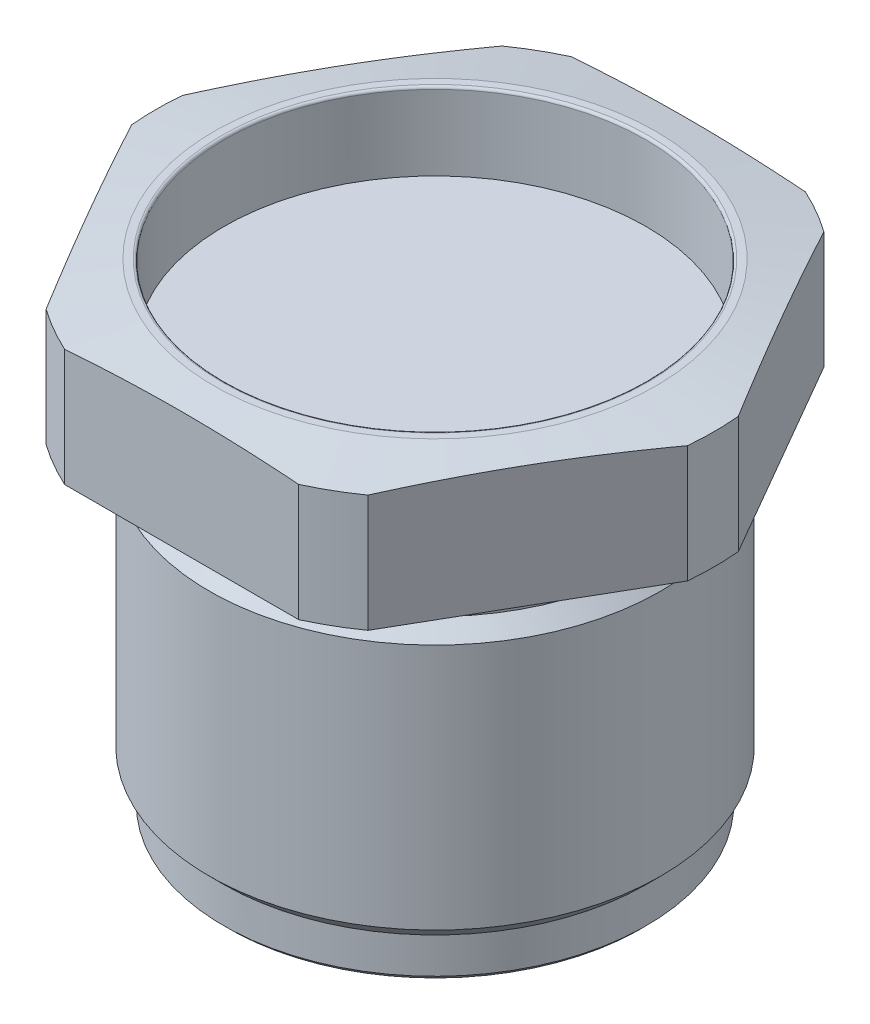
ISO-10303-21;
HEADER;
FILE_DESCRIPTION(('STEP AP214'),'2;1');
FILE_NAME('part.step','',(''),(''),'','','');
FILE_SCHEMA(('AUTOMOTIVE_DESIGN { 1 0 10303 214 1 1 1 1 }'));
ENDSEC;
DATA;
#1=APPLICATION_CONTEXT('core data for automotive mechanical design processes');
#2=APPLICATION_PROTOCOL_DEFINITION('international standard','automotive_design',2000,#1);
#3=PRODUCT_CONTEXT('',#1,'mechanical');
#4=PRODUCT('Part','Part','',(#3));
#5=PRODUCT_RELATED_PRODUCT_CATEGORY('part','',(#4));
#6=PRODUCT_DEFINITION_FORMATION('','',#4);
#7=PRODUCT_DEFINITION_CONTEXT('part definition',#1,'design');
#8=PRODUCT_DEFINITION('design','',#6,#7);
#9=PRODUCT_DEFINITION_SHAPE('','',#8);
#10=(LENGTH_UNIT() NAMED_UNIT(*) SI_UNIT(.MILLI.,.METRE.));
#11=(NAMED_UNIT(*) PLANE_ANGLE_UNIT() SI_UNIT($,.RADIAN.));
#12=(NAMED_UNIT(*) SI_UNIT($,.STERADIAN.) SOLID_ANGLE_UNIT());
#13=UNCERTAINTY_MEASURE_WITH_UNIT(LENGTH_MEASURE(1.E-05),#10,'distance_accuracy_value','');
#14=(GEOMETRIC_REPRESENTATION_CONTEXT(3) GLOBAL_UNCERTAINTY_ASSIGNED_CONTEXT((#13)) GLOBAL_UNIT_ASSIGNED_CONTEXT((#10,
#11,#12)) REPRESENTATION_CONTEXT('',''));
#15=CARTESIAN_POINT('',(0.,0.,0.));
#16=DIRECTION('',(0.,0.,1.));
#17=DIRECTION('',(1.,0.,0.));
#18=AXIS2_PLACEMENT_3D('',#15,#16,#17);
#19=CARTESIAN_POINT('',(21.0566,-34.8488,0.));
#20=DIRECTION('',(0.,-1.,0.));
#21=DIRECTION('',(0.,0.,-1.));
#22=AXIS2_PLACEMENT_3D('',#19,#20,#21);
#23=PLANE('',#22);
#24=CARTESIAN_POINT('',(0.,-34.8488,0.));
#25=DIRECTION('',(0.,-1.,0.));
#26=DIRECTION('',(0.,0.,-1.));
#27=AXIS2_PLACEMENT_3D('',#24,#25,#26);
#28=CIRCLE('',#27,18.8976);
#29=CARTESIAN_POINT('',(0.,-34.8488,-18.8976));
#30=VERTEX_POINT('',#29);
#31=EDGE_CURVE('E12',#30,#30,#28,.T.);
#32=ORIENTED_EDGE('',*,*,#31,.F.);
#33=EDGE_LOOP('',(#32));
#34=FACE_BOUND('',#33,.T.);
#35=CARTESIAN_POINT('',(0.,-34.8488,0.));
#36=DIRECTION('',(0.,-1.,0.));
#37=DIRECTION('',(0.,0.,-1.));
#38=AXIS2_PLACEMENT_3D('',#35,#36,#37);
#39=CIRCLE('',#38,20.55660224);
#40=CARTESIAN_POINT('',(0.,-34.8488,-20.55660224));
#41=VERTEX_POINT('',#40);
#42=EDGE_CURVE('E183',#41,#41,#39,.T.);
#43=ORIENTED_EDGE('',*,*,#42,.T.);
#44=EDGE_LOOP('',(#43));
#45=FACE_BOUND('',#44,.T.);
#46=ADVANCED_FACE('F39',(#34,#45),#23,.T.);
#47=CARTESIAN_POINT('',(0.,-8.96894233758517,0.));
#48=DIRECTION('',(0.,-1.,0.));
#49=DIRECTION('',(0.,0.,-1.));
#50=AXIS2_PLACEMENT_3D('',#47,#48,#49);
#51=CYLINDRICAL_SURFACE('',#50,21.0566);
#52=CARTESIAN_POINT('',(0.,-1.016,0.));
#53=DIRECTION('',(0.,-1.,0.));
#54=DIRECTION('',(0.,0.,-1.));
#55=AXIS2_PLACEMENT_3D('',#52,#53,#54);
#56=CIRCLE('',#55,21.0566);
#57=CARTESIAN_POINT('',(0.,-1.016,-21.0566));
#58=VERTEX_POINT('',#57);
#59=EDGE_CURVE('E195',#58,#58,#56,.T.);
#60=ORIENTED_EDGE('',*,*,#59,.T.);
#61=EDGE_LOOP('',(#60));
#62=FACE_BOUND('',#61,.T.);
#63=CARTESIAN_POINT('',(0.,-3.302,0.));
#64=DIRECTION('',(0.,-1.,0.));
#65=DIRECTION('',(1.,0.,0.));
#66=AXIS2_PLACEMENT_3D('',#63,#64,#65);
#67=CIRCLE('',#66,21.0566);
#68=CARTESIAN_POINT('',(21.0566,-3.302,0.));
#69=VERTEX_POINT('',#68);
#70=EDGE_CURVE('E192',#69,#69,#67,.T.);
#71=ORIENTED_EDGE('',*,*,#70,.F.);
#72=EDGE_LOOP('',(#71));
#73=FACE_BOUND('',#72,.T.);
#74=ADVANCED_FACE('F308',(#62,#73),#51,.T.);
#75=CARTESIAN_POINT('',(0.,11.6743764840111,0.));
#76=DIRECTION('',(0.,-1.,0.));
#77=DIRECTION('',(0.,0.,-1.));
#78=AXIS2_PLACEMENT_3D('',#75,#76,#77);
#79=CONICAL_SURFACE('',#78,27.813,1.39626340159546);
#80=CARTESIAN_POINT('',(0.,12.7,0.));
#81=DIRECTION('',(0.,-1.,0.));
#82=DIRECTION('',(0.,0.,-1.));
#83=AXIS2_PLACEMENT_3D('',#80,#81,#82);
#84=CIRCLE('',#83,21.9964);
#85=CARTESIAN_POINT('',(0.,12.7,-21.9964));
#86=VERTEX_POINT('',#85);
#87=EDGE_CURVE('E287',#86,#86,#84,.T.);
#88=ORIENTED_EDGE('',*,*,#87,.T.);
#89=EDGE_LOOP('',(#88));
#90=FACE_BOUND('',#89,.T.);
#91=CARTESIAN_POINT('',(0.,11.6743764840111,0.));
#92=DIRECTION('',(0.,-1.,0.));
#93=DIRECTION('',(0.,0.,-1.));
#94=AXIS2_PLACEMENT_3D('',#91,#92,#93);
#95=CIRCLE('',#94,27.813);
#96=CARTESIAN_POINT('',(-27.6981005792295,11.6743764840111,2.52550852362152));
#97=VERTEX_POINT('',#96);
#98=CARTESIAN_POINT('',(-27.6981005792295,11.6743764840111,-2.5255085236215));
#99=VERTEX_POINT('',#98);
#100=EDGE_CURVE('E143',#97,#99,#95,.T.);
#101=ORIENTED_EDGE('',*,*,#100,.F.);
#102=CARTESIAN_POINT('',(-27.699453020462,11.6741764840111,2.52316602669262));
#103=CARTESIAN_POINT('',(-27.4566948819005,11.7100797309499,2.94363545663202));
#104=CARTESIAN_POINT('',(-27.2138691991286,11.7441442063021,3.36422187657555));
#105=CARTESIAN_POINT('',(-26.7280857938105,11.8083518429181,4.20562341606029));
#106=CARTESIAN_POINT('',(-26.485128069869,11.8384949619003,4.62643853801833));
#107=CARTESIAN_POINT('',(-25.7560383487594,11.9226790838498,5.88925897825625));
#108=CARTESIAN_POINT('',(-25.269720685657,11.9704702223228,6.73158587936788));
#109=CARTESIAN_POINT('',(-24.2974521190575,12.0476317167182,8.41560443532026));
#110=CARTESIAN_POINT('',(-23.8115017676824,12.077029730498,9.25729513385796));
#111=CARTESIAN_POINT('',(-22.8394185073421,12.1163636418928,10.9409927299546));
#112=CARTESIAN_POINT('',(-22.3532856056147,12.1263002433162,11.7829996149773));
#113=CARTESIAN_POINT('',(-21.3810198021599,12.1263002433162,13.4670133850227));
#114=CARTESIAN_POINT('',(-20.8948869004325,12.1163636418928,14.3090202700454));
#115=CARTESIAN_POINT('',(-19.9228036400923,12.077029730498,15.992717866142));
#116=CARTESIAN_POINT('',(-19.4368532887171,12.0476317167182,16.8344085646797));
#117=CARTESIAN_POINT('',(-18.4645847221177,11.9704702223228,18.5184271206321));
#118=CARTESIAN_POINT('',(-17.9782670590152,11.9226790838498,19.3607540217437));
#119=CARTESIAN_POINT('',(-17.2491773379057,11.8384949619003,20.6235744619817));
#120=CARTESIAN_POINT('',(-17.0062196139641,11.8083518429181,21.0443895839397));
#121=CARTESIAN_POINT('',(-16.5204362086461,11.7441442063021,21.8857911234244));
#122=CARTESIAN_POINT('',(-16.2776105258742,11.7100797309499,22.306377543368));
#123=CARTESIAN_POINT('',(-16.0348523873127,11.6741764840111,22.7268469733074));
#124=B_SPLINE_CURVE_WITH_KNOTS('',3,(#102,#103,#104,#105,#106,#107,#108,#109,#110,#111,#112,
#113,#114,#115,#116,#117,#118,#119,#120,#121,#122,#123),.UNSPECIFIED.,.F.,.F.,(4,2,2,2,2,2,2,2,
2,2,4),(0.,1.46051952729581,2.92105480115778,5.84231114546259,8.75916415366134,11.6759116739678,
14.5926591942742,17.5095122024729,20.4307685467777,21.8913038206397,23.3518233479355),.UNSPECIFIED.);
#125=CARTESIAN_POINT('',(-16.0362048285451,11.6743764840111,22.7245044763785));
#126=VERTEX_POINT('',#125);
#127=EDGE_CURVE('E277',#97,#126,#124,.T.);
#128=ORIENTED_EDGE('',*,*,#127,.T.);
#129=CARTESIAN_POINT('',(-11.6618957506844,11.6743764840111,25.250013));
#130=VERTEX_POINT('',#129);
#131=EDGE_CURVE('E401',#130,#126,#95,.T.);
#132=ORIENTED_EDGE('',*,*,#131,.F.);
#133=CARTESIAN_POINT('',(-38.45442568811,8.466931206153,25.250013));
#134=CARTESIAN_POINT('',(-37.3088939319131,8.63573012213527,25.250013));
#135=CARTESIAN_POINT('',(-36.1630410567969,8.80238834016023,25.250013));
#136=CARTESIAN_POINT('',(-33.8705391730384,9.1302907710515,25.250013));
#137=CARTESIAN_POINT('',(-32.7238901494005,9.2915348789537,25.250013));
#138=CARTESIAN_POINT('',(-30.4291954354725,9.60753746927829,25.250013));
#139=CARTESIAN_POINT('',(-29.2811493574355,9.76229314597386,25.250013));
#140=CARTESIAN_POINT('',(-26.9839990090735,10.0637355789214,25.250013));
#141=CARTESIAN_POINT('',(-25.8348947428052,10.2104223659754,25.250013));
#142=CARTESIAN_POINT('',(-23.5393242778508,10.4933831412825,25.250013));
#143=CARTESIAN_POINT('',(-22.3928622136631,10.6296905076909,25.250013));
#144=CARTESIAN_POINT('',(-20.0985472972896,10.890150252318,25.250013));
#145=CARTESIAN_POINT('',(-18.9506944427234,11.0143026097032,25.250013));
#146=CARTESIAN_POINT('',(-16.653535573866,11.2476996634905,25.250013));
#147=CARTESIAN_POINT('',(-15.5042296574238,11.3569453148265,25.250013));
#148=CARTESIAN_POINT('',(-13.2040281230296,11.5573856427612,25.250013));
#149=CARTESIAN_POINT('',(-12.0531325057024,11.6485803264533,25.250013));
#150=CARTESIAN_POINT('',(-9.74440831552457,11.809935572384,25.250013));
#151=CARTESIAN_POINT('',(-8.5865725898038,11.87999521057,25.250013));
#152=CARTESIAN_POINT('',(-6.26965491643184,11.9952859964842,25.250013));
#153=CARTESIAN_POINT('',(-5.11057297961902,12.040517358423,25.250013));
#154=CARTESIAN_POINT('',(-2.79186198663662,12.1037192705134,25.250013));
#155=CARTESIAN_POINT('',(-1.632233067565,12.121694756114,25.250013));
#156=CARTESIAN_POINT('',(0.687119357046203,12.1293464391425,25.250013));
#157=CARTESIAN_POINT('',(1.84684286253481,12.1190226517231,25.250013));
#158=CARTESIAN_POINT('',(4.16752278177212,12.0706496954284,25.250013));
#159=CARTESIAN_POINT('',(5.32847827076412,12.0325570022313,25.250013));
#160=CARTESIAN_POINT('',(7.6492527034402,11.9307119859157,25.250013));
#161=CARTESIAN_POINT('',(8.80907163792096,11.8669594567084,25.250013));
#162=CARTESIAN_POINT('',(11.1275218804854,11.7168527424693,25.250013));
#163=CARTESIAN_POINT('',(12.2861528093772,11.6304927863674,25.250013));
#164=CARTESIAN_POINT('',(14.601809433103,11.4386022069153,25.250013));
#165=CARTESIAN_POINT('',(15.7588351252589,11.3330715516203,25.250013));
#166=CARTESIAN_POINT('',(18.0088025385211,11.1122678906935,25.250013));
#167=CARTESIAN_POINT('',(19.1018270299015,10.9978300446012,25.250013));
#168=CARTESIAN_POINT('',(21.2865901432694,10.7572197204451,25.250013));
#169=CARTESIAN_POINT('',(22.3783287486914,10.6310470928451,25.250013));
#170=CARTESIAN_POINT('',(24.5606961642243,10.3690640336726,25.250013));
#171=CARTESIAN_POINT('',(25.6513249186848,10.2332531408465,25.250013));
#172=CARTESIAN_POINT('',(27.831561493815,9.9537333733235,25.250013));
#173=CARTESIAN_POINT('',(28.9211693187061,9.81002453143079,25.250013));
#174=CARTESIAN_POINT('',(31.0996706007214,9.51609433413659,25.250013));
#175=CARTESIAN_POINT('',(32.1885639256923,9.3658720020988,25.250013));
#176=CARTESIAN_POINT('',(34.3655970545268,9.06006925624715,25.250013));
#177=CARTESIAN_POINT('',(35.4537368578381,8.90448883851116,25.250013));
#178=CARTESIAN_POINT('',(37.6293381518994,8.58888814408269,25.250013));
#179=CARTESIAN_POINT('',(38.7167996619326,8.42886800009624,25.250013));
#180=CARTESIAN_POINT('',(40.8911698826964,8.10511156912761,25.250013));
#181=CARTESIAN_POINT('',(41.9780785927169,7.94137527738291,25.250013));
#182=CARTESIAN_POINT('',(45.2288133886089,7.44692280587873,25.250013));
#183=CARTESIAN_POINT('',(47.3919393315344,7.11160393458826,25.250013));
#184=CARTESIAN_POINT('',(51.7168144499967,6.43212081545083,25.250013));
#185=CARTESIAN_POINT('',(53.8785636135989,6.08795649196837,25.250013));
#186=CARTESIAN_POINT('',(58.199655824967,5.39328895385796,25.250013));
#187=CARTESIAN_POINT('',(60.3589995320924,5.04278983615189,25.250013));
#188=CARTESIAN_POINT('',(63.5973888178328,4.51332317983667,25.250013));
#189=CARTESIAN_POINT('',(64.6767392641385,4.33621600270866,25.250013));
#190=CARTESIAN_POINT('',(66.835259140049,3.98090532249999,25.250013));
#191=CARTESIAN_POINT('',(67.9144285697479,3.80270181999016,25.250013));
#192=CARTESIAN_POINT('',(68.9935191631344,3.62402199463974,25.250013));
#193=B_SPLINE_CURVE_WITH_KNOTS('',3,(#133,#134,#135,#136,#137,#138,#139,#140,#141,#142,#143,
#144,#145,#146,#147,#148,#149,#150,#151,#152,#153,#154,#155,#156,#157,#158,#159,#160,#161,#162,
#163,#164,#165,#166,#167,#168,#169,#170,#171,#172,#173,#174,#175,#176,#177,#178,#179,#180,#181,
#182,#183,#184,#185,#186,#187,#188,#189,#190,#191,#192),.UNSPECIFIED.,.F.,.F.,(4,2,2,2,2,2,2,2,
2,2,2,2,2,2,2,2,2,2,2,2,2,2,2,2,2,2,2,2,2,4),(0.,3.47371114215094,6.9474895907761,
10.4227549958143,13.8980071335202,17.3615650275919,20.8251288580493,24.2884707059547,
27.7518111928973,31.2314371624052,34.7110331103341,38.1899989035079,41.6689628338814,
45.1533913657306,48.637847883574,52.1231947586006,55.6085474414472,58.9054693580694,
62.2024332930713,65.4995551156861,68.796663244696,72.0942674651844,75.3918740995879,
78.6893822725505,81.9868946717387,88.5537497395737,95.1206609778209,101.683467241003,
104.964820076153,108.246171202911),.UNSPECIFIED.);
#194=CARTESIAN_POINT('',(11.6618957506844,11.6743764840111,25.250013));
#195=VERTEX_POINT('',#194);
#196=EDGE_CURVE('E384',#130,#195,#193,.T.);
#197=ORIENTED_EDGE('',*,*,#196,.T.);
#198=CARTESIAN_POINT('',(16.0362048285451,11.6743764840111,22.7245044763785));
#199=VERTEX_POINT('',#198);
#200=EDGE_CURVE('E410',#199,#195,#95,.T.);
#201=ORIENTED_EDGE('',*,*,#200,.F.);
#202=CARTESIAN_POINT('',(16.0348523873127,11.6741764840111,22.7268469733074));
#203=CARTESIAN_POINT('',(16.2776105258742,11.7100797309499,22.306377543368));
#204=CARTESIAN_POINT('',(16.5204362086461,11.7441442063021,21.8857911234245));
#205=CARTESIAN_POINT('',(17.0062196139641,11.8083518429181,21.0443895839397));
#206=CARTESIAN_POINT('',(17.2491773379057,11.8384949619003,20.6235744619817));
#207=CARTESIAN_POINT('',(17.9782670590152,11.9226790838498,19.3607540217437));
#208=CARTESIAN_POINT('',(18.4645847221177,11.9704702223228,18.5184271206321));
#209=CARTESIAN_POINT('',(19.4368532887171,12.0476317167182,16.8344085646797));
#210=CARTESIAN_POINT('',(19.9228036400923,12.077029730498,15.992717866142));
#211=CARTESIAN_POINT('',(20.8948869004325,12.1163636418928,14.3090202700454));
#212=CARTESIAN_POINT('',(21.3810198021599,12.1263002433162,13.4670133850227));
#213=CARTESIAN_POINT('',(22.3532856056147,12.1263002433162,11.7829996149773));
#214=CARTESIAN_POINT('',(22.8394185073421,12.1163636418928,10.9409927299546));
#215=CARTESIAN_POINT('',(23.8115017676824,12.077029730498,9.25729513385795));
#216=CARTESIAN_POINT('',(24.2974521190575,12.0476317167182,8.41560443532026));
#217=CARTESIAN_POINT('',(25.269720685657,11.9704702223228,6.73158587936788));
#218=CARTESIAN_POINT('',(25.7560383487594,11.9226790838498,5.88925897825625));
#219=CARTESIAN_POINT('',(26.485128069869,11.8384949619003,4.62643853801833));
#220=CARTESIAN_POINT('',(26.7280857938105,11.8083518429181,4.20562341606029));
#221=CARTESIAN_POINT('',(27.2138691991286,11.7441442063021,3.36422187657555));
#222=CARTESIAN_POINT('',(27.4566948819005,11.7100797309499,2.94363545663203));
#223=CARTESIAN_POINT('',(27.699453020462,11.6741764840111,2.52316602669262));
#224=B_SPLINE_CURVE_WITH_KNOTS('',3,(#202,#203,#204,#205,#206,#207,#208,#209,#210,#211,#212,
#213,#214,#215,#216,#217,#218,#219,#220,#221,#222,#223),.UNSPECIFIED.,.F.,.F.,(4,2,2,2,2,2,2,2,
2,2,4),(0.,1.46051952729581,2.92105480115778,5.84231114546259,8.75916415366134,11.6759116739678,
14.5926591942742,17.5095122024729,20.4307685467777,21.8913038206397,23.3518233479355),.UNSPECIFIED.);
#225=CARTESIAN_POINT('',(27.6981005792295,11.6743764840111,2.5255085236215));
#226=VERTEX_POINT('',#225);
#227=EDGE_CURVE('E412',#199,#226,#224,.T.);
#228=ORIENTED_EDGE('',*,*,#227,.T.);
#229=CARTESIAN_POINT('',(27.6981005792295,11.6743764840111,-2.52550852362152));
#230=VERTEX_POINT('',#229);
#231=EDGE_CURVE('E166',#230,#226,#95,.T.);
#232=ORIENTED_EDGE('',*,*,#231,.F.);
#233=CARTESIAN_POINT('',(27.699453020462,11.6741764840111,-2.52316602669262));
#234=CARTESIAN_POINT('',(27.4566948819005,11.7100797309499,-2.94363545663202));
#235=CARTESIAN_POINT('',(27.2138691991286,11.7441442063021,-3.36422187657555));
#236=CARTESIAN_POINT('',(26.7280857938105,11.8083518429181,-4.20562341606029));
#237=CARTESIAN_POINT('',(26.485128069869,11.8384949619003,-4.62643853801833));
#238=CARTESIAN_POINT('',(25.7560383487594,11.9226790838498,-5.88925897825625));
#239=CARTESIAN_POINT('',(25.269720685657,11.9704702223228,-6.73158587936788));
#240=CARTESIAN_POINT('',(24.2974521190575,12.0476317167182,-8.41560443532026));
#241=CARTESIAN_POINT('',(23.8115017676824,12.077029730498,-9.25729513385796));
#242=CARTESIAN_POINT('',(22.8394185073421,12.1163636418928,-10.9409927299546));
#243=CARTESIAN_POINT('',(22.3532856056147,12.1263002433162,-11.7829996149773));
#244=CARTESIAN_POINT('',(21.3810198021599,12.1263002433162,-13.4670133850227));
#245=CARTESIAN_POINT('',(20.8948869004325,12.1163636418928,-14.3090202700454));
#246=CARTESIAN_POINT('',(19.9228036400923,12.077029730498,-15.992717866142));
#247=CARTESIAN_POINT('',(19.4368532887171,12.0476317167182,-16.8344085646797));
#248=CARTESIAN_POINT('',(18.4645847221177,11.9704702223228,-18.5184271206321));
#249=CARTESIAN_POINT('',(17.9782670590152,11.9226790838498,-19.3607540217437));
#250=CARTESIAN_POINT('',(17.2491773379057,11.8384949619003,-20.6235744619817));
#251=CARTESIAN_POINT('',(17.0062196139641,11.8083518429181,-21.0443895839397));
#252=CARTESIAN_POINT('',(16.5204362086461,11.7441442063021,-21.8857911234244));
#253=CARTESIAN_POINT('',(16.2776105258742,11.7100797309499,-22.306377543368));
#254=CARTESIAN_POINT('',(16.0348523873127,11.6741764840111,-22.7268469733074));
#255=B_SPLINE_CURVE_WITH_KNOTS('',3,(#233,#234,#235,#236,#237,#238,#239,#240,#241,#242,#243,
#244,#245,#246,#247,#248,#249,#250,#251,#252,#253,#254),.UNSPECIFIED.,.F.,.F.,(4,2,2,2,2,2,2,2,
2,2,4),(0.,1.46051952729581,2.92105480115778,5.84231114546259,8.75916415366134,11.6759116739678,
14.5926591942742,17.5095122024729,20.4307685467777,21.8913038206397,23.3518233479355),.UNSPECIFIED.);
#256=CARTESIAN_POINT('',(16.0362048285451,11.6743764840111,-22.7245044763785));
#257=VERTEX_POINT('',#256);
#258=EDGE_CURVE('E426',#230,#257,#255,.T.);
#259=ORIENTED_EDGE('',*,*,#258,.T.);
#260=CARTESIAN_POINT('',(11.6618957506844,11.6743764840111,-25.250013));
#261=VERTEX_POINT('',#260);
#262=EDGE_CURVE('E162',#261,#257,#95,.T.);
#263=ORIENTED_EDGE('',*,*,#262,.F.);
#264=CARTESIAN_POINT('',(-38.45442568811,8.466931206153,-25.250013));
#265=CARTESIAN_POINT('',(-37.3088939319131,8.63573012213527,-25.250013));
#266=CARTESIAN_POINT('',(-36.1630410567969,8.80238834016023,-25.250013));
#267=CARTESIAN_POINT('',(-33.8705391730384,9.1302907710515,-25.250013));
#268=CARTESIAN_POINT('',(-32.7238901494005,9.2915348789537,-25.250013));
#269=CARTESIAN_POINT('',(-30.4291954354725,9.60753746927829,-25.250013));
#270=CARTESIAN_POINT('',(-29.2811493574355,9.76229314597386,-25.250013));
#271=CARTESIAN_POINT('',(-26.9839990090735,10.0637355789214,-25.250013));
#272=CARTESIAN_POINT('',(-25.8348947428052,10.2104223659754,-25.250013));
#273=CARTESIAN_POINT('',(-23.5393242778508,10.4933831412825,-25.250013));
#274=CARTESIAN_POINT('',(-22.3928622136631,10.6296905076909,-25.250013));
#275=CARTESIAN_POINT('',(-20.0985472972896,10.890150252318,-25.250013));
#276=CARTESIAN_POINT('',(-18.9506944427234,11.0143026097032,-25.250013));
#277=CARTESIAN_POINT('',(-16.653535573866,11.2476996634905,-25.250013));
#278=CARTESIAN_POINT('',(-15.5042296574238,11.3569453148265,-25.250013));
#279=CARTESIAN_POINT('',(-13.2040281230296,11.5573856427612,-25.250013));
#280=CARTESIAN_POINT('',(-12.0531325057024,11.6485803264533,-25.250013));
#281=CARTESIAN_POINT('',(-9.74440831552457,11.809935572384,-25.250013));
#282=CARTESIAN_POINT('',(-8.5865725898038,11.87999521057,-25.250013));
#283=CARTESIAN_POINT('',(-6.26965491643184,11.9952859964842,-25.250013));
#284=CARTESIAN_POINT('',(-5.11057297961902,12.040517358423,-25.250013));
#285=CARTESIAN_POINT('',(-2.79186198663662,12.1037192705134,-25.250013));
#286=CARTESIAN_POINT('',(-1.632233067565,12.121694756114,-25.250013));
#287=CARTESIAN_POINT('',(0.687119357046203,12.1293464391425,-25.250013));
#288=CARTESIAN_POINT('',(1.84684286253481,12.1190226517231,-25.250013));
#289=CARTESIAN_POINT('',(4.16752278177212,12.0706496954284,-25.250013));
#290=CARTESIAN_POINT('',(5.32847827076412,12.0325570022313,-25.250013));
#291=CARTESIAN_POINT('',(7.6492527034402,11.9307119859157,-25.250013));
#292=CARTESIAN_POINT('',(8.80907163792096,11.8669594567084,-25.250013));
#293=CARTESIAN_POINT('',(11.1275218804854,11.7168527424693,-25.250013));
#294=CARTESIAN_POINT('',(12.2861528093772,11.6304927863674,-25.250013));
#295=CARTESIAN_POINT('',(14.601809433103,11.4386022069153,-25.250013));
#296=CARTESIAN_POINT('',(15.7588351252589,11.3330715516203,-25.250013));
#297=CARTESIAN_POINT('',(18.0088025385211,11.1122678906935,-25.250013));
#298=CARTESIAN_POINT('',(19.1018270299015,10.9978300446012,-25.250013));
#299=CARTESIAN_POINT('',(21.2865901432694,10.7572197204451,-25.250013));
#300=CARTESIAN_POINT('',(22.3783287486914,10.6310470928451,-25.250013));
#301=CARTESIAN_POINT('',(24.5606961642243,10.3690640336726,-25.250013));
#302=CARTESIAN_POINT('',(25.6513249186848,10.2332531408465,-25.250013));
#303=CARTESIAN_POINT('',(27.831561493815,9.9537333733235,-25.250013));
#304=CARTESIAN_POINT('',(28.9211693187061,9.81002453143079,-25.250013));
#305=CARTESIAN_POINT('',(31.0996706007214,9.51609433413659,-25.250013));
#306=CARTESIAN_POINT('',(32.1885639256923,9.3658720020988,-25.250013));
#307=CARTESIAN_POINT('',(34.3655970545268,9.06006925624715,-25.250013));
#308=CARTESIAN_POINT('',(35.4537368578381,8.90448883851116,-25.250013));
#309=CARTESIAN_POINT('',(37.6293381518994,8.58888814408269,-25.250013));
#310=CARTESIAN_POINT('',(38.7167996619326,8.42886800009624,-25.250013));
#311=CARTESIAN_POINT('',(40.8911698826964,8.10511156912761,-25.250013));
#312=CARTESIAN_POINT('',(41.9780785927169,7.94137527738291,-25.250013));
#313=CARTESIAN_POINT('',(45.2288133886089,7.44692280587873,-25.250013));
#314=CARTESIAN_POINT('',(47.3919393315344,7.11160393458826,-25.250013));
#315=CARTESIAN_POINT('',(51.7168144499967,6.43212081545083,-25.250013));
#316=CARTESIAN_POINT('',(53.8785636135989,6.08795649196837,-25.250013));
#317=CARTESIAN_POINT('',(58.199655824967,5.39328895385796,-25.250013));
#318=CARTESIAN_POINT('',(60.3589995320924,5.04278983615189,-25.250013));
#319=CARTESIAN_POINT('',(63.5973888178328,4.51332317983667,-25.250013));
#320=CARTESIAN_POINT('',(64.6767392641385,4.33621600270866,-25.250013));
#321=CARTESIAN_POINT('',(66.835259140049,3.98090532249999,-25.250013));
#322=CARTESIAN_POINT('',(67.9144285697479,3.80270181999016,-25.250013));
#323=CARTESIAN_POINT('',(68.9935191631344,3.62402199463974,-25.250013));
#324=B_SPLINE_CURVE_WITH_KNOTS('',3,(#264,#265,#266,#267,#268,#269,#270,#271,#272,#273,#274,
#275,#276,#277,#278,#279,#280,#281,#282,#283,#284,#285,#286,#287,#288,#289,#290,#291,#292,#293,
#294,#295,#296,#297,#298,#299,#300,#301,#302,#303,#304,#305,#306,#307,#308,#309,#310,#311,#312,
#313,#314,#315,#316,#317,#318,#319,#320,#321,#322,#323),.UNSPECIFIED.,.F.,.F.,(4,2,2,2,2,2,2,2,
2,2,2,2,2,2,2,2,2,2,2,2,2,2,2,2,2,2,2,2,2,4),(0.,3.47371114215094,6.9474895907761,
10.4227549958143,13.8980071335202,17.3615650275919,20.8251288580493,24.2884707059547,
27.7518111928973,31.2314371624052,34.7110331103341,38.1899989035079,41.6689628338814,
45.1533913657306,48.637847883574,52.1231947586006,55.6085474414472,58.9054693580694,
62.2024332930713,65.4995551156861,68.796663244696,72.0942674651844,75.3918740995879,
78.6893822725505,81.9868946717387,88.5537497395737,95.1206609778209,101.683467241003,
104.964820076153,108.246171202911),.UNSPECIFIED.);
#325=CARTESIAN_POINT('',(-11.6618957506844,11.6743764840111,-25.250013));
#326=VERTEX_POINT('',#325);
#327=EDGE_CURVE('E460',#261,#326,#324,.F.);
#328=ORIENTED_EDGE('',*,*,#327,.T.);
#329=CARTESIAN_POINT('',(-16.0362048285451,11.6743764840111,-22.7245044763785));
#330=VERTEX_POINT('',#329);
#331=EDGE_CURVE('E159',#330,#326,#95,.T.);
#332=ORIENTED_EDGE('',*,*,#331,.F.);
#333=CARTESIAN_POINT('',(-16.0348523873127,11.6741764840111,-22.7268469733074));
#334=CARTESIAN_POINT('',(-16.2776105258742,11.7100797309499,-22.306377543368));
#335=CARTESIAN_POINT('',(-16.5204362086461,11.7441442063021,-21.8857911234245));
#336=CARTESIAN_POINT('',(-17.0062196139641,11.8083518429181,-21.0443895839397));
#337=CARTESIAN_POINT('',(-17.2491773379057,11.8384949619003,-20.6235744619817));
#338=CARTESIAN_POINT('',(-17.9782670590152,11.9226790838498,-19.3607540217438));
#339=CARTESIAN_POINT('',(-18.4645847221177,11.9704702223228,-18.5184271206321));
#340=CARTESIAN_POINT('',(-19.4368532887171,12.0476317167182,-16.8344085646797));
#341=CARTESIAN_POINT('',(-19.9228036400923,12.077029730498,-15.992717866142));
#342=CARTESIAN_POINT('',(-20.8948869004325,12.1163636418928,-14.3090202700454));
#343=CARTESIAN_POINT('',(-21.3810198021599,12.1263002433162,-13.4670133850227));
#344=CARTESIAN_POINT('',(-22.3532856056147,12.1263002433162,-11.7829996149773));
#345=CARTESIAN_POINT('',(-22.8394185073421,12.1163636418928,-10.9409927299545));
#346=CARTESIAN_POINT('',(-23.8115017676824,12.077029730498,-9.25729513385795));
#347=CARTESIAN_POINT('',(-24.2974521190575,12.0476317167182,-8.41560443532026));
#348=CARTESIAN_POINT('',(-25.269720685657,11.9704702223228,-6.73158587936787));
#349=CARTESIAN_POINT('',(-25.7560383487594,11.9226790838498,-5.88925897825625));
#350=CARTESIAN_POINT('',(-26.485128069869,11.8384949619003,-4.62643853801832));
#351=CARTESIAN_POINT('',(-26.7280857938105,11.8083518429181,-4.20562341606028));
#352=CARTESIAN_POINT('',(-27.2138691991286,11.7441442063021,-3.36422187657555));
#353=CARTESIAN_POINT('',(-27.4566948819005,11.7100797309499,-2.94363545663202));
#354=CARTESIAN_POINT('',(-27.699453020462,11.6741764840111,-2.52316602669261));
#355=B_SPLINE_CURVE_WITH_KNOTS('',3,(#333,#334,#335,#336,#337,#338,#339,#340,#341,#342,#343,
#344,#345,#346,#347,#348,#349,#350,#351,#352,#353,#354),.UNSPECIFIED.,.F.,.F.,(4,2,2,2,2,2,2,2,
2,2,4),(0.,1.46051952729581,2.92105480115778,5.84231114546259,8.75916415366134,11.6759116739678,
14.5926591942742,17.5095122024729,20.4307685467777,21.8913038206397,23.3518233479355),.UNSPECIFIED.);
#356=EDGE_CURVE('E144',#330,#99,#355,.T.);
#357=ORIENTED_EDGE('',*,*,#356,.T.);
#358=EDGE_LOOP('',(#101,#128,#132,#197,#201,#228,#232,#259,#263,#328,#332,#357));
#359=FACE_BOUND('',#358,.T.);
#360=ADVANCED_FACE('F256',(#90,#359),#79,.T.);
#361=CARTESIAN_POINT('',(0.,-8.96894233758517,0.));
#362=DIRECTION('',(0.,-1.,0.));
#363=DIRECTION('',(0.,0.,-1.));
#364=AXIS2_PLACEMENT_3D('',#361,#362,#363);
#365=CYLINDRICAL_SURFACE('',#364,27.813);
#366=CARTESIAN_POINT('',(0.,0.,0.));
#367=DIRECTION('',(0.,-1.,0.));
#368=DIRECTION('',(0.,0.,-1.));
#369=AXIS2_PLACEMENT_3D('',#366,#367,#368);
#370=CIRCLE('',#369,27.813);
#371=CARTESIAN_POINT('',(-27.6981005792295,0.,2.52550852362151));
#372=VERTEX_POINT('',#371);
#373=CARTESIAN_POINT('',(-27.6981005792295,0.,-2.5255085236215));
#374=VERTEX_POINT('',#373);
#375=EDGE_CURVE('E141',#372,#374,#370,.T.);
#376=ORIENTED_EDGE('',*,*,#375,.F.);
#377=DIRECTION('',(0.,-1.,0.));
#378=VECTOR('',#377,1.);
#379=CARTESIAN_POINT('',(-27.6981005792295,-8.96894233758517,2.5255085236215));
#380=LINE('',#379,#378);
#381=EDGE_CURVE('E62',#372,#97,#380,.F.);
#382=ORIENTED_EDGE('',*,*,#381,.T.);
#383=ORIENTED_EDGE('',*,*,#100,.T.);
#384=DIRECTION('',(0.,-1.,0.));
#385=VECTOR('',#384,1.);
#386=CARTESIAN_POINT('',(-27.6981005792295,-8.96894233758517,-2.5255085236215));
#387=LINE('',#386,#385);
#388=EDGE_CURVE('E128',#99,#374,#387,.T.);
#389=ORIENTED_EDGE('',*,*,#388,.T.);
#390=EDGE_LOOP('',(#376,#382,#383,#389));
#391=FACE_BOUND('',#390,.T.);
#392=ADVANCED_FACE('F140',(#391),#365,.T.);
#393=ORIENTED_EDGE('',*,*,#131,.T.);
#394=DIRECTION('',(0.,-1.,0.));
#395=VECTOR('',#394,1.);
#396=CARTESIAN_POINT('',(-16.0362048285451,-8.96894233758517,22.7245044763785));
#397=LINE('',#396,#395);
#398=CARTESIAN_POINT('',(-16.0362048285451,0.,22.7245044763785));
#399=VERTEX_POINT('',#398);
#400=EDGE_CURVE('E285',#126,#399,#397,.T.);
#401=ORIENTED_EDGE('',*,*,#400,.T.);
#402=CARTESIAN_POINT('',(-11.6618957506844,0.,25.250013));
#403=VERTEX_POINT('',#402);
#404=EDGE_CURVE('E150',#403,#399,#370,.T.);
#405=ORIENTED_EDGE('',*,*,#404,.F.);
#406=DIRECTION('',(0.,-1.,0.));
#407=VECTOR('',#406,1.);
#408=CARTESIAN_POINT('',(-11.6618957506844,-8.96894233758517,25.250013));
#409=LINE('',#408,#407);
#410=EDGE_CURVE('E391',#403,#130,#409,.F.);
#411=ORIENTED_EDGE('',*,*,#410,.T.);
#412=EDGE_LOOP('',(#393,#401,#405,#411));
#413=FACE_BOUND('',#412,.T.);
#414=ADVANCED_FACE('F400',(#413),#365,.T.);
#415=ORIENTED_EDGE('',*,*,#200,.T.);
#416=DIRECTION('',(0.,-1.,0.));
#417=VECTOR('',#416,1.);
#418=CARTESIAN_POINT('',(11.6618957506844,-8.96894233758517,25.250013));
#419=LINE('',#418,#417);
#420=CARTESIAN_POINT('',(11.6618957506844,0.,25.250013));
#421=VERTEX_POINT('',#420);
#422=EDGE_CURVE('E392',#195,#421,#419,.T.);
#423=ORIENTED_EDGE('',*,*,#422,.T.);
#424=CARTESIAN_POINT('',(16.0362048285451,0.,22.7245044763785));
#425=VERTEX_POINT('',#424);
#426=EDGE_CURVE('E153',#425,#421,#370,.T.);
#427=ORIENTED_EDGE('',*,*,#426,.F.);
#428=DIRECTION('',(0.,-1.,0.));
#429=VECTOR('',#428,1.);
#430=CARTESIAN_POINT('',(16.0362048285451,-8.96894233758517,22.7245044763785));
#431=LINE('',#430,#429);
#432=EDGE_CURVE('E411',#425,#199,#431,.F.);
#433=ORIENTED_EDGE('',*,*,#432,.T.);
#434=EDGE_LOOP('',(#415,#423,#427,#433));
#435=FACE_BOUND('',#434,.T.);
#436=ADVANCED_FACE('F407',(#435),#365,.T.);
#437=ORIENTED_EDGE('',*,*,#231,.T.);
#438=DIRECTION('',(0.,-1.,0.));
#439=VECTOR('',#438,1.);
#440=CARTESIAN_POINT('',(27.6981005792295,-8.96894233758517,2.5255085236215));
#441=LINE('',#440,#439);
#442=CARTESIAN_POINT('',(27.6981005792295,0.,2.5255085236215));
#443=VERTEX_POINT('',#442);
#444=EDGE_CURVE('E414',#226,#443,#441,.T.);
#445=ORIENTED_EDGE('',*,*,#444,.T.);
#446=CARTESIAN_POINT('',(27.6981005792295,0.,-2.52550852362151));
#447=VERTEX_POINT('',#446);
#448=EDGE_CURVE('E160',#447,#443,#370,.T.);
#449=ORIENTED_EDGE('',*,*,#448,.F.);
#450=DIRECTION('',(0.,-1.,0.));
#451=VECTOR('',#450,1.);
#452=CARTESIAN_POINT('',(27.6981005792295,-8.96894233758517,-2.5255085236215));
#453=LINE('',#452,#451);
#454=EDGE_CURVE('E423',#447,#230,#453,.F.);
#455=ORIENTED_EDGE('',*,*,#454,.T.);
#456=EDGE_LOOP('',(#437,#445,#449,#455));
#457=FACE_BOUND('',#456,.T.);
#458=ADVANCED_FACE('F470',(#457),#365,.T.);
#459=ORIENTED_EDGE('',*,*,#262,.T.);
#460=DIRECTION('',(0.,-1.,0.));
#461=VECTOR('',#460,1.);
#462=CARTESIAN_POINT('',(16.0362048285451,-8.96894233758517,-22.7245044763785));
#463=LINE('',#462,#461);
#464=CARTESIAN_POINT('',(16.0362048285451,0.,-22.7245044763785));
#465=VERTEX_POINT('',#464);
#466=EDGE_CURVE('E433',#257,#465,#463,.T.);
#467=ORIENTED_EDGE('',*,*,#466,.T.);
#468=CARTESIAN_POINT('',(11.6618957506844,0.,-25.250013));
#469=VERTEX_POINT('',#468);
#470=EDGE_CURVE('E155',#469,#465,#370,.T.);
#471=ORIENTED_EDGE('',*,*,#470,.F.);
#472=DIRECTION('',(0.,-1.,0.));
#473=VECTOR('',#472,1.);
#474=CARTESIAN_POINT('',(11.6618957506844,-8.96894233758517,-25.250013));
#475=LINE('',#474,#473);
#476=EDGE_CURVE('E453',#469,#261,#475,.F.);
#477=ORIENTED_EDGE('',*,*,#476,.T.);
#478=EDGE_LOOP('',(#459,#467,#471,#477));
#479=FACE_BOUND('',#478,.T.);
#480=ADVANCED_FACE('F450',(#479),#365,.T.);
#481=ORIENTED_EDGE('',*,*,#331,.T.);
#482=DIRECTION('',(0.,-1.,0.));
#483=VECTOR('',#482,1.);
#484=CARTESIAN_POINT('',(-11.6618957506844,-8.96894233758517,-25.250013));
#485=LINE('',#484,#483);
#486=CARTESIAN_POINT('',(-11.6618957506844,0.,-25.250013));
#487=VERTEX_POINT('',#486);
#488=EDGE_CURVE('E455',#326,#487,#485,.T.);
#489=ORIENTED_EDGE('',*,*,#488,.T.);
#490=CARTESIAN_POINT('',(-16.0362048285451,0.,-22.7245044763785));
#491=VERTEX_POINT('',#490);
#492=EDGE_CURVE('E151',#491,#487,#370,.T.);
#493=ORIENTED_EDGE('',*,*,#492,.F.);
#494=DIRECTION('',(0.,-1.,0.));
#495=VECTOR('',#494,1.);
#496=CARTESIAN_POINT('',(-16.0362048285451,-8.96894233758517,-22.7245044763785));
#497=LINE('',#496,#495);
#498=EDGE_CURVE('E54',#491,#330,#497,.F.);
#499=ORIENTED_EDGE('',*,*,#498,.T.);
#500=EDGE_LOOP('',(#481,#489,#493,#499));
#501=FACE_BOUND('',#500,.T.);
#502=ADVANCED_FACE('F304',(#501),#365,.T.);
#503=CARTESIAN_POINT('',(27.813,0.,0.));
#504=DIRECTION('',(0.,-1.,0.));
#505=DIRECTION('',(0.,0.,-1.));
#506=AXIS2_PLACEMENT_3D('',#503,#504,#505);
#507=PLANE('',#506);
#508=CARTESIAN_POINT('',(0.,0.,0.));
#509=DIRECTION('',(0.,-1.,0.));
#510=DIRECTION('',(0.,0.,-1.));
#511=AXIS2_PLACEMENT_3D('',#508,#509,#510);
#512=CIRCLE('',#511,22.0726);
#513=CARTESIAN_POINT('',(0.,0.,-22.0726));
#514=VERTEX_POINT('',#513);
#515=EDGE_CURVE('E198',#514,#514,#512,.F.);
#516=ORIENTED_EDGE('',*,*,#515,.T.);
#517=EDGE_LOOP('',(#516));
#518=FACE_BOUND('',#517,.T.);
#519=ORIENTED_EDGE('',*,*,#404,.T.);
#520=DIRECTION('',(-0.5,0.,-0.866025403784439));
#521=VECTOR('',#520,1.);
#522=CARTESIAN_POINT('',(-14.9139027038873,0.,24.6683887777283));
#523=LINE('',#522,#521);
#524=EDGE_CURVE('E149',#399,#372,#523,.T.);
#525=ORIENTED_EDGE('',*,*,#524,.T.);
#526=ORIENTED_EDGE('',*,*,#375,.T.);
#527=DIRECTION('',(0.5,0.,-0.866025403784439));
#528=VECTOR('',#527,1.);
#529=CARTESIAN_POINT('',(-14.9139027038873,0.,-24.6683887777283));
#530=LINE('',#529,#528);
#531=EDGE_CURVE('E125',#374,#491,#530,.T.);
#532=ORIENTED_EDGE('',*,*,#531,.T.);
#533=ORIENTED_EDGE('',*,*,#492,.T.);
#534=DIRECTION('',(1.,0.,0.));
#535=VECTOR('',#534,1.);
#536=CARTESIAN_POINT('',(27.813,0.,-25.250013));
#537=LINE('',#536,#535);
#538=EDGE_CURVE('E134',#487,#469,#537,.T.);
#539=ORIENTED_EDGE('',*,*,#538,.T.);
#540=ORIENTED_EDGE('',*,*,#470,.T.);
#541=DIRECTION('',(0.5,0.,0.866025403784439));
#542=VECTOR('',#541,1.);
#543=CARTESIAN_POINT('',(28.8204027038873,0.,-0.581624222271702));
#544=LINE('',#543,#542);
#545=EDGE_CURVE('E173',#465,#447,#544,.T.);
#546=ORIENTED_EDGE('',*,*,#545,.T.);
#547=ORIENTED_EDGE('',*,*,#448,.T.);
#548=DIRECTION('',(-0.5,0.,0.866025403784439));
#549=VECTOR('',#548,1.);
#550=CARTESIAN_POINT('',(28.8204027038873,0.,0.581624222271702));
#551=LINE('',#550,#549);
#552=EDGE_CURVE('E176',#443,#425,#551,.T.);
#553=ORIENTED_EDGE('',*,*,#552,.T.);
#554=ORIENTED_EDGE('',*,*,#426,.T.);
#555=DIRECTION('',(-1.,0.,0.));
#556=VECTOR('',#555,1.);
#557=CARTESIAN_POINT('',(27.813,0.,25.250013));
#558=LINE('',#557,#556);
#559=EDGE_CURVE('E179',#421,#403,#558,.T.);
#560=ORIENTED_EDGE('',*,*,#559,.T.);
#561=EDGE_LOOP('',(#519,#525,#526,#532,#533,#539,#540,#546,#547,#553,#554,#560));
#562=FACE_BOUND('',#561,.T.);
#563=ADVANCED_FACE('F148',(#518,#562),#507,.T.);
#564=CARTESIAN_POINT('',(21.0185,4.9784,0.));
#565=DIRECTION('',(0.,1.,0.));
#566=DIRECTION('',(0.,0.,1.));
#567=AXIS2_PLACEMENT_3D('',#564,#565,#566);
#568=PLANE('',#567);
#569=CARTESIAN_POINT('',(0.,4.9784,0.));
#570=DIRECTION('',(0.,-1.,0.));
#571=DIRECTION('',(0.,0.,-1.));
#572=AXIS2_PLACEMENT_3D('',#569,#570,#571);
#573=CIRCLE('',#572,21.0185);
#574=CARTESIAN_POINT('',(0.,4.9784,-21.0185));
#575=VERTEX_POINT('',#574);
#576=EDGE_CURVE('E154',#575,#575,#573,.T.);
#577=ORIENTED_EDGE('',*,*,#576,.F.);
#578=EDGE_LOOP('',(#577));
#579=FACE_BOUND('',#578,.T.);
#580=ADVANCED_FACE('F296',(#579),#568,.T.);
#581=CARTESIAN_POINT('',(0.,-8.96894233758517,0.));
#582=DIRECTION('',(0.,-1.,0.));
#583=DIRECTION('',(0.,0.,-1.));
#584=AXIS2_PLACEMENT_3D('',#581,#582,#583);
#585=CYLINDRICAL_SURFACE('',#584,21.0185);
#586=CARTESIAN_POINT('',(0.,12.45,0.));
#587=DIRECTION('',(0.,1.,0.));
#588=DIRECTION('',(0.,0.,1.));
#589=AXIS2_PLACEMENT_3D('',#586,#587,#588);
#590=CIRCLE('',#589,21.0185);
#591=CARTESIAN_POINT('',(0.,12.45,21.0185));
#592=VERTEX_POINT('',#591);
#593=EDGE_CURVE('E135',#592,#592,#590,.T.);
#594=ORIENTED_EDGE('',*,*,#593,.T.);
#595=EDGE_LOOP('',(#594));
#596=FACE_BOUND('',#595,.T.);
#597=ORIENTED_EDGE('',*,*,#576,.T.);
#598=EDGE_LOOP('',(#597));
#599=FACE_BOUND('',#598,.T.);
#600=ADVANCED_FACE('F294',(#596,#599),#585,.F.);
#601=CARTESIAN_POINT('',(21.0185,12.7,0.));
#602=DIRECTION('',(0.,1.,0.));
#603=DIRECTION('',(0.,0.,1.));
#604=AXIS2_PLACEMENT_3D('',#601,#602,#603);
#605=PLANE('',#604);
#606=CARTESIAN_POINT('',(0.,12.7,0.));
#607=DIRECTION('',(0.,1.,0.));
#608=DIRECTION('',(0.,0.,1.));
#609=AXIS2_PLACEMENT_3D('',#606,#607,#608);
#610=CIRCLE('',#609,21.2685);
#611=CARTESIAN_POINT('',(0.,12.7,21.2685));
#612=VERTEX_POINT('',#611);
#613=EDGE_CURVE('E165',#612,#612,#610,.F.);
#614=ORIENTED_EDGE('',*,*,#613,.T.);
#615=EDGE_LOOP('',(#614));
#616=FACE_BOUND('',#615,.T.);
#617=ORIENTED_EDGE('',*,*,#87,.F.);
#618=EDGE_LOOP('',(#617));
#619=FACE_BOUND('',#618,.T.);
#620=ADVANCED_FACE('F274',(#616,#619),#605,.T.);
#621=CARTESIAN_POINT('',(0.,12.45,0.));
#622=DIRECTION('',(0.,1.,0.));
#623=DIRECTION('',(0.,0.,1.));
#624=AXIS2_PLACEMENT_3D('',#621,#622,#623);
#625=TOROIDAL_SURFACE('',#624,21.2685,0.25);
#626=ORIENTED_EDGE('',*,*,#593,.F.);
#627=EDGE_LOOP('',(#626));
#628=FACE_BOUND('',#627,.T.);
#629=ORIENTED_EDGE('',*,*,#613,.F.);
#630=EDGE_LOOP('',(#629));
#631=FACE_BOUND('',#630,.T.);
#632=ADVANCED_FACE('F265',(#628,#631),#625,.T.);
#633=CARTESIAN_POINT('',(-14.5781018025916,12.7,-25.250013));
#634=DIRECTION('',(-0.866025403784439,0.,-0.5));
#635=DIRECTION('',(-0.5,0.,0.866025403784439));
#636=AXIS2_PLACEMENT_3D('',#633,#634,#635);
#637=PLANE('',#636);
#638=ORIENTED_EDGE('',*,*,#531,.F.);
#639=ORIENTED_EDGE('',*,*,#388,.F.);
#640=ORIENTED_EDGE('',*,*,#356,.F.);
#641=ORIENTED_EDGE('',*,*,#498,.F.);
#642=EDGE_LOOP('',(#638,#639,#640,#641));
#643=FACE_BOUND('',#642,.T.);
#644=ADVANCED_FACE('F127',(#643),#637,.T.);
#645=CARTESIAN_POINT('',(14.5781018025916,12.7,-25.250013));
#646=DIRECTION('',(0.,0.,-1.));
#647=DIRECTION('',(-1.,0.,0.));
#648=AXIS2_PLACEMENT_3D('',#645,#646,#647);
#649=PLANE('',#648);
#650=ORIENTED_EDGE('',*,*,#538,.F.);
#651=ORIENTED_EDGE('',*,*,#488,.F.);
#652=ORIENTED_EDGE('',*,*,#327,.F.);
#653=ORIENTED_EDGE('',*,*,#476,.F.);
#654=EDGE_LOOP('',(#650,#651,#652,#653));
#655=FACE_BOUND('',#654,.T.);
#656=ADVANCED_FACE('F264',(#655),#649,.T.);
#657=CARTESIAN_POINT('',(29.1562036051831,12.7,0.));
#658=DIRECTION('',(0.866025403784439,0.,-0.5));
#659=DIRECTION('',(-0.5,0.,-0.866025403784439));
#660=AXIS2_PLACEMENT_3D('',#657,#658,#659);
#661=PLANE('',#660);
#662=ORIENTED_EDGE('',*,*,#545,.F.);
#663=ORIENTED_EDGE('',*,*,#466,.F.);
#664=ORIENTED_EDGE('',*,*,#258,.F.);
#665=ORIENTED_EDGE('',*,*,#454,.F.);
#666=EDGE_LOOP('',(#662,#663,#664,#665));
#667=FACE_BOUND('',#666,.T.);
#668=ADVANCED_FACE('F435',(#667),#661,.T.);
#669=CARTESIAN_POINT('',(14.5781018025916,12.7,25.250013));
#670=DIRECTION('',(0.866025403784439,0.,0.5));
#671=DIRECTION('',(0.5,0.,-0.866025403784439));
#672=AXIS2_PLACEMENT_3D('',#669,#670,#671);
#673=PLANE('',#672);
#674=ORIENTED_EDGE('',*,*,#552,.F.);
#675=ORIENTED_EDGE('',*,*,#444,.F.);
#676=ORIENTED_EDGE('',*,*,#227,.F.);
#677=ORIENTED_EDGE('',*,*,#432,.F.);
#678=EDGE_LOOP('',(#674,#675,#676,#677));
#679=FACE_BOUND('',#678,.T.);
#680=ADVANCED_FACE('F380',(#679),#673,.T.);
#681=CARTESIAN_POINT('',(-14.5781018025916,12.7,25.250013));
#682=DIRECTION('',(0.,0.,1.));
#683=DIRECTION('',(1.,0.,0.));
#684=AXIS2_PLACEMENT_3D('',#681,#682,#683);
#685=PLANE('',#684);
#686=ORIENTED_EDGE('',*,*,#559,.F.);
#687=ORIENTED_EDGE('',*,*,#422,.F.);
#688=ORIENTED_EDGE('',*,*,#196,.F.);
#689=ORIENTED_EDGE('',*,*,#410,.F.);
#690=EDGE_LOOP('',(#686,#687,#688,#689));
#691=FACE_BOUND('',#690,.T.);
#692=ADVANCED_FACE('F273',(#691),#685,.T.);
#693=CARTESIAN_POINT('',(-29.1562036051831,12.7,0.));
#694=DIRECTION('',(-0.866025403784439,0.,0.5));
#695=DIRECTION('',(0.5,0.,0.866025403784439));
#696=AXIS2_PLACEMENT_3D('',#693,#694,#695);
#697=PLANE('',#696);
#698=ORIENTED_EDGE('',*,*,#524,.F.);
#699=ORIENTED_EDGE('',*,*,#400,.F.);
#700=ORIENTED_EDGE('',*,*,#127,.F.);
#701=ORIENTED_EDGE('',*,*,#381,.F.);
#702=EDGE_LOOP('',(#698,#699,#700,#701));
#703=FACE_BOUND('',#702,.T.);
#704=ADVANCED_FACE('F268',(#703),#697,.T.);
#705=CARTESIAN_POINT('',(0.,-3.302,0.));
#706=DIRECTION('',(0.,-1.,0.));
#707=DIRECTION('',(1.,0.,0.));
#708=AXIS2_PLACEMENT_3D('',#705,#706,#707);
#709=CONICAL_SURFACE('',#708,21.0566,0.785398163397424);
#710=CARTESIAN_POINT('',(0.,-4.74540000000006,0.));
#711=DIRECTION('',(0.,1.,0.));
#712=DIRECTION('',(-1.,0.,0.));
#713=AXIS2_PLACEMENT_3D('',#710,#711,#712);
#714=CIRCLE('',#713,22.5);
#715=CARTESIAN_POINT('',(-22.5,-4.74540000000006,0.));
#716=VERTEX_POINT('',#715);
#717=EDGE_CURVE('E145',#716,#716,#714,.T.);
#718=ORIENTED_EDGE('',*,*,#717,.T.);
#719=EDGE_LOOP('',(#718));
#720=FACE_BOUND('',#719,.T.);
#721=ORIENTED_EDGE('',*,*,#70,.T.);
#722=EDGE_LOOP('',(#721));
#723=FACE_BOUND('',#722,.T.);
#724=ADVANCED_FACE('F272',(#720,#723),#709,.T.);
#725=CARTESIAN_POINT('',(0.,0.,0.));
#726=DIRECTION('',(0.,1.,0.));
#727=DIRECTION('',(-1.,0.,0.));
#728=AXIS2_PLACEMENT_3D('',#725,#726,#727);
#729=CYLINDRICAL_SURFACE('',#728,22.5);
#730=CARTESIAN_POINT('',(0.,-29.3414000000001,0.));
#731=DIRECTION('',(0.,1.,0.));
#732=DIRECTION('',(-1.,0.,0.));
#733=AXIS2_PLACEMENT_3D('',#730,#731,#732);
#734=CIRCLE('',#733,22.5);
#735=CARTESIAN_POINT('',(-22.5,-29.3414000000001,0.));
#736=VERTEX_POINT('',#735);
#737=EDGE_CURVE('E243',#736,#736,#734,.T.);
#738=ORIENTED_EDGE('',*,*,#737,.T.);
#739=EDGE_LOOP('',(#738));
#740=FACE_BOUND('',#739,.T.);
#741=ORIENTED_EDGE('',*,*,#717,.F.);
#742=EDGE_LOOP('',(#741));
#743=FACE_BOUND('',#742,.T.);
#744=ADVANCED_FACE('F369',(#740,#743),#729,.T.);
#745=CARTESIAN_POINT('',(0.,-29.3414000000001,0.));
#746=DIRECTION('',(0.,1.,0.));
#747=DIRECTION('',(-1.,0.,0.));
#748=AXIS2_PLACEMENT_3D('',#745,#746,#747);
#749=CONICAL_SURFACE('',#748,22.5,0.785398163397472);
#750=CARTESIAN_POINT('',(0.,-30.7848,0.));
#751=DIRECTION('',(0.,1.,0.));
#752=DIRECTION('',(-1.,0.,0.));
#753=AXIS2_PLACEMENT_3D('',#750,#751,#752);
#754=CIRCLE('',#753,21.0566);
#755=CARTESIAN_POINT('',(-21.0566,-30.7848,0.));
#756=VERTEX_POINT('',#755);
#757=EDGE_CURVE('E189',#756,#756,#754,.T.);
#758=ORIENTED_EDGE('',*,*,#757,.T.);
#759=EDGE_LOOP('',(#758));
#760=FACE_BOUND('',#759,.T.);
#761=ORIENTED_EDGE('',*,*,#737,.F.);
#762=EDGE_LOOP('',(#761));
#763=FACE_BOUND('',#762,.T.);
#764=ADVANCED_FACE('F365',(#760,#763),#749,.T.);
#765=CARTESIAN_POINT('',(0.,-34.8488,0.));
#766=DIRECTION('',(0.,1.,0.));
#767=DIRECTION('',(0.,0.,1.));
#768=AXIS2_PLACEMENT_3D('',#765,#766,#767);
#769=CONICAL_SURFACE('',#768,20.55660224,0.785398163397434);
#770=CARTESIAN_POINT('',(0.,-34.34880224,0.));
#771=DIRECTION('',(0.,-1.,0.));
#772=DIRECTION('',(0.,0.,-1.));
#773=AXIS2_PLACEMENT_3D('',#770,#771,#772);
#774=CIRCLE('',#773,21.0566);
#775=CARTESIAN_POINT('',(0.,-34.34880224,-21.0566));
#776=VERTEX_POINT('',#775);
#777=EDGE_CURVE('E186',#776,#776,#774,.F.);
#778=ORIENTED_EDGE('',*,*,#777,.F.);
#779=EDGE_LOOP('',(#778));
#780=FACE_BOUND('',#779,.T.);
#781=ORIENTED_EDGE('',*,*,#42,.F.);
#782=EDGE_LOOP('',(#781));
#783=FACE_BOUND('',#782,.T.);
#784=ADVANCED_FACE('F368',(#780,#783),#769,.T.);
#785=ORIENTED_EDGE('',*,*,#757,.F.);
#786=EDGE_LOOP('',(#785));
#787=FACE_BOUND('',#786,.T.);
#788=ORIENTED_EDGE('',*,*,#777,.T.);
#789=EDGE_LOOP('',(#788));
#790=FACE_BOUND('',#789,.T.);
#791=ADVANCED_FACE('F316',(#787,#790),#51,.T.);
#792=CARTESIAN_POINT('',(0.,-1.016,0.));
#793=DIRECTION('',(0.,-1.,0.));
#794=DIRECTION('',(0.,0.,-1.));
#795=AXIS2_PLACEMENT_3D('',#792,#793,#794);
#796=TOROIDAL_SURFACE('',#795,22.0726,1.016);
#797=ORIENTED_EDGE('',*,*,#515,.F.);
#798=EDGE_LOOP('',(#797));
#799=FACE_BOUND('',#798,.T.);
#800=ORIENTED_EDGE('',*,*,#59,.F.);
#801=EDGE_LOOP('',(#800));
#802=FACE_BOUND('',#801,.T.);
#803=ADVANCED_FACE('F41',(#799,#802),#796,.F.);
#804=CARTESIAN_POINT('',(0.,-34.3154,0.));
#805=DIRECTION('',(0.,1.,0.));
#806=DIRECTION('',(0.,0.,1.));
#807=AXIS2_PLACEMENT_3D('',#804,#805,#806);
#808=TOROIDAL_SURFACE('',#807,18.1864,0.889000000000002);
#809=ORIENTED_EDGE('',*,*,#31,.T.);
#810=EDGE_LOOP('',(#809));
#811=FACE_BOUND('',#810,.T.);
#812=CARTESIAN_POINT('',(0.,-34.8488,0.));
#813=DIRECTION('',(0.,1.,0.));
#814=DIRECTION('',(0.,0.,1.));
#815=AXIS2_PLACEMENT_3D('',#812,#813,#814);
#816=CIRCLE('',#815,17.4752);
#817=CARTESIAN_POINT('',(0.,-34.8488,17.4752));
#818=VERTEX_POINT('',#817);
#819=EDGE_CURVE('E47',#818,#818,#816,.T.);
#820=ORIENTED_EDGE('',*,*,#819,.T.);
#821=EDGE_LOOP('',(#820));
#822=FACE_BOUND('',#821,.T.);
#823=ADVANCED_FACE('F203',(#811,#822),#808,.T.);
#824=CARTESIAN_POINT('',(0.,-33.4772,0.));
#825=DIRECTION('',(0.,-1.,0.));
#826=DIRECTION('',(1.,0.,0.));
#827=AXIS2_PLACEMENT_3D('',#824,#825,#826);
#828=PLANE('',#827);
#829=CARTESIAN_POINT('',(0.,-33.4772,0.));
#830=DIRECTION('',(0.,1.,0.));
#831=DIRECTION('',(-1.,0.,0.));
#832=AXIS2_PLACEMENT_3D('',#829,#830,#831);
#833=CIRCLE('',#832,7.5819);
#834=CARTESIAN_POINT('',(-7.5819,-33.4772,0.));
#835=VERTEX_POINT('',#834);
#836=EDGE_CURVE('E240',#835,#835,#833,.T.);
#837=ORIENTED_EDGE('',*,*,#836,.F.);
#838=EDGE_LOOP('',(#837));
#839=FACE_BOUND('',#838,.T.);
#840=ADVANCED_FACE('F344',(#839),#828,.T.);
#841=CARTESIAN_POINT('',(0.,0.,0.));
#842=DIRECTION('',(0.,1.,0.));
#843=DIRECTION('',(-1.,0.,0.));
#844=AXIS2_PLACEMENT_3D('',#841,#842,#843);
#845=CYLINDRICAL_SURFACE('',#844,7.5819);
#846=ORIENTED_EDGE('',*,*,#836,.T.);
#847=EDGE_LOOP('',(#846));
#848=FACE_BOUND('',#847,.T.);
#849=CARTESIAN_POINT('',(0.,-34.8488,0.));
#850=DIRECTION('',(0.,1.,0.));
#851=DIRECTION('',(-1.,0.,0.));
#852=AXIS2_PLACEMENT_3D('',#849,#850,#851);
#853=CIRCLE('',#852,7.5819);
#854=CARTESIAN_POINT('',(-7.5819,-34.8488,0.));
#855=VERTEX_POINT('',#854);
#856=EDGE_CURVE('E237',#855,#855,#853,.T.);
#857=ORIENTED_EDGE('',*,*,#856,.F.);
#858=EDGE_LOOP('',(#857));
#859=FACE_BOUND('',#858,.T.);
#860=ADVANCED_FACE('F336',(#848,#859),#845,.F.);
#861=ORIENTED_EDGE('',*,*,#856,.T.);
#862=EDGE_LOOP('',(#861));
#863=FACE_BOUND('',#862,.T.);
#864=CARTESIAN_POINT('',(0.,-34.8488,0.));
#865=DIRECTION('',(0.,1.,0.));
#866=DIRECTION('',(-1.,0.,0.));
#867=AXIS2_PLACEMENT_3D('',#864,#865,#866);
#868=CIRCLE('',#867,9.3853);
#869=CARTESIAN_POINT('',(-9.38529999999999,-34.8488,0.));
#870=VERTEX_POINT('',#869);
#871=EDGE_CURVE('E231',#870,#870,#868,.T.);
#872=ORIENTED_EDGE('',*,*,#871,.F.);
#873=EDGE_LOOP('',(#872));
#874=FACE_BOUND('',#873,.T.);
#875=ADVANCED_FACE('F210',(#863,#874),#23,.T.);
#876=CARTESIAN_POINT('',(0.,0.,0.));
#877=DIRECTION('',(0.,1.,0.));
#878=DIRECTION('',(-1.,0.,0.));
#879=AXIS2_PLACEMENT_3D('',#876,#877,#878);
#880=CYLINDRICAL_SURFACE('',#879,9.3853);
#881=ORIENTED_EDGE('',*,*,#871,.T.);
#882=EDGE_LOOP('',(#881));
#883=FACE_BOUND('',#882,.T.);
#884=CARTESIAN_POINT('',(0.,-34.3154,0.));
#885=DIRECTION('',(0.,1.,0.));
#886=DIRECTION('',(-1.,0.,0.));
#887=AXIS2_PLACEMENT_3D('',#884,#885,#886);
#888=CIRCLE('',#887,9.3853);
#889=CARTESIAN_POINT('',(-9.38529999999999,-34.3154,0.));
#890=VERTEX_POINT('',#889);
#891=EDGE_CURVE('E234',#890,#890,#888,.T.);
#892=ORIENTED_EDGE('',*,*,#891,.F.);
#893=EDGE_LOOP('',(#892));
#894=FACE_BOUND('',#893,.T.);
#895=ADVANCED_FACE('F335',(#883,#894),#880,.T.);
#896=CARTESIAN_POINT('',(0.,-34.3154,0.));
#897=DIRECTION('',(0.,1.,0.));
#898=DIRECTION('',(-1.,0.,0.));
#899=AXIS2_PLACEMENT_3D('',#896,#897,#898);
#900=TOROIDAL_SURFACE('',#899,10.2743,0.888999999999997);
#901=ORIENTED_EDGE('',*,*,#891,.T.);
#902=EDGE_LOOP('',(#901));
#903=FACE_BOUND('',#902,.T.);
#904=CARTESIAN_POINT('',(0.,-34.3154,0.));
#905=DIRECTION('',(0.,1.,0.));
#906=DIRECTION('',(-1.,0.,0.));
#907=AXIS2_PLACEMENT_3D('',#904,#905,#906);
#908=CIRCLE('',#907,11.1633);
#909=CARTESIAN_POINT('',(-11.1633,-34.3154,0.));
#910=VERTEX_POINT('',#909);
#911=EDGE_CURVE('E219',#910,#910,#908,.T.);
#912=ORIENTED_EDGE('',*,*,#911,.F.);
#913=EDGE_LOOP('',(#912));
#914=FACE_BOUND('',#913,.T.);
#915=ADVANCED_FACE('F330',(#903,#914),#900,.T.);
#916=CARTESIAN_POINT('',(0.,0.,0.));
#917=DIRECTION('',(0.,1.,0.));
#918=DIRECTION('',(-1.,0.,0.));
#919=AXIS2_PLACEMENT_3D('',#916,#917,#918);
#920=CYLINDRICAL_SURFACE('',#919,11.1633);
#921=ORIENTED_EDGE('',*,*,#911,.T.);
#922=EDGE_LOOP('',(#921));
#923=FACE_BOUND('',#922,.T.);
#924=CARTESIAN_POINT('',(0.,-34.8488,0.));
#925=DIRECTION('',(0.,1.,0.));
#926=DIRECTION('',(-1.,0.,0.));
#927=AXIS2_PLACEMENT_3D('',#924,#925,#926);
#928=CIRCLE('',#927,11.1633);
#929=CARTESIAN_POINT('',(-11.1633,-34.8488,0.));
#930=VERTEX_POINT('',#929);
#931=EDGE_CURVE('E228',#930,#930,#928,.T.);
#932=ORIENTED_EDGE('',*,*,#931,.F.);
#933=EDGE_LOOP('',(#932));
#934=FACE_BOUND('',#933,.T.);
#935=ADVANCED_FACE('F321',(#923,#934),#920,.F.);
#936=ORIENTED_EDGE('',*,*,#931,.T.);
#937=EDGE_LOOP('',(#936));
#938=FACE_BOUND('',#937,.T.);
#939=CARTESIAN_POINT('',(0.,-34.8488,0.));
#940=DIRECTION('',(0.,1.,0.));
#941=DIRECTION('',(-1.,0.,0.));
#942=AXIS2_PLACEMENT_3D('',#939,#940,#941);
#943=CIRCLE('',#942,12.192);
#944=CARTESIAN_POINT('',(-12.192,-34.8488,0.));
#945=VERTEX_POINT('',#944);
#946=EDGE_CURVE('E215',#945,#945,#943,.T.);
#947=ORIENTED_EDGE('',*,*,#946,.F.);
#948=EDGE_LOOP('',(#947));
#949=FACE_BOUND('',#948,.T.);
#950=ADVANCED_FACE('F310',(#938,#949),#23,.T.);
#951=CARTESIAN_POINT('',(0.,-34.8488,0.));
#952=DIRECTION('',(0.,1.,0.));
#953=DIRECTION('',(-1.,0.,0.));
#954=AXIS2_PLACEMENT_3D('',#951,#952,#953);
#955=TOROIDAL_SURFACE('',#954,13.5636,1.3716);
#956=ORIENTED_EDGE('',*,*,#946,.T.);
#957=EDGE_LOOP('',(#956));
#958=FACE_BOUND('',#957,.T.);
#959=CARTESIAN_POINT('',(0.,-33.4772,0.));
#960=DIRECTION('',(0.,1.,0.));
#961=DIRECTION('',(-1.,0.,0.));
#962=AXIS2_PLACEMENT_3D('',#959,#960,#961);
#963=CIRCLE('',#962,13.5636);
#964=CARTESIAN_POINT('',(-13.5636,-33.4772,0.));
#965=VERTEX_POINT('',#964);
#966=EDGE_CURVE('E222',#965,#965,#963,.T.);
#967=ORIENTED_EDGE('',*,*,#966,.F.);
#968=EDGE_LOOP('',(#967));
#969=FACE_BOUND('',#968,.T.);
#970=ADVANCED_FACE('F320',(#958,#969),#955,.F.);
#971=CARTESIAN_POINT('',(13.5636,-33.4772,0.));
#972=DIRECTION('',(0.,-1.,0.));
#973=DIRECTION('',(1.,0.,0.));
#974=AXIS2_PLACEMENT_3D('',#971,#972,#973);
#975=PLANE('',#974);
#976=ORIENTED_EDGE('',*,*,#966,.T.);
#977=EDGE_LOOP('',(#976));
#978=FACE_BOUND('',#977,.T.);
#979=CARTESIAN_POINT('',(0.,-33.4772,0.));
#980=DIRECTION('',(0.,1.,0.));
#981=DIRECTION('',(-1.,0.,0.));
#982=AXIS2_PLACEMENT_3D('',#979,#980,#981);
#983=CIRCLE('',#982,18.1864);
#984=CARTESIAN_POINT('',(-18.1864,-33.4772,0.));
#985=VERTEX_POINT('',#984);
#986=EDGE_CURVE('E216',#985,#985,#983,.T.);
#987=ORIENTED_EDGE('',*,*,#986,.F.);
#988=EDGE_LOOP('',(#987));
#989=FACE_BOUND('',#988,.T.);
#990=ADVANCED_FACE('F327',(#978,#989),#975,.T.);
#991=CARTESIAN_POINT('',(0.,-34.3662,0.));
#992=DIRECTION('',(0.,1.,0.));
#993=DIRECTION('',(-1.,0.,0.));
#994=AXIS2_PLACEMENT_3D('',#991,#992,#993);
#995=TOROIDAL_SURFACE('',#994,18.1864,0.889000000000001);
#996=ORIENTED_EDGE('',*,*,#986,.T.);
#997=EDGE_LOOP('',(#996));
#998=FACE_BOUND('',#997,.T.);
#999=CARTESIAN_POINT('',(0.,-34.8488,0.));
#1000=DIRECTION('',(0.,1.,0.));
#1001=DIRECTION('',(-1.,0.,0.));
#1002=AXIS2_PLACEMENT_3D('',#999,#1000,#1001);
#1003=CIRCLE('',#1002,17.4397955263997);
#1004=CARTESIAN_POINT('',(-17.4397955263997,-34.8488,0.));
#1005=VERTEX_POINT('',#1004);
#1006=EDGE_CURVE('E213',#1005,#1005,#1003,.T.);
#1007=ORIENTED_EDGE('',*,*,#1006,.F.);
#1008=EDGE_LOOP('',(#1007));
#1009=FACE_BOUND('',#1008,.T.);
#1010=ADVANCED_FACE('F208',(#998,#1009),#995,.T.);
#1011=ORIENTED_EDGE('',*,*,#819,.F.);
#1012=EDGE_LOOP('',(#1011));
#1013=FACE_BOUND('',#1012,.T.);
#1014=ORIENTED_EDGE('',*,*,#1006,.T.);
#1015=EDGE_LOOP('',(#1014));
#1016=FACE_BOUND('',#1015,.T.);
#1017=ADVANCED_FACE('F205',(#1013,#1016),#23,.T.);
#1018=CLOSED_SHELL('',(#46,#74,#360,#392,#414,#436,#458,#480,#502,#563,#580,#600,#620,#632,#644,
#656,#668,#680,#692,#704,#724,#744,#764,#784,#791,#803,#823,#840,#860,#875,#895,#915,#935,#950,
#970,#990,#1010,#1017));
#1019=MANIFOLD_SOLID_BREP('B2',#1018);
#1020=ADVANCED_BREP_SHAPE_REPRESENTATION('',(#18,#1019),#14);
#1021=SHAPE_DEFINITION_REPRESENTATION(#9,#1020);
ENDSEC;
END-ISO-10303-21;
